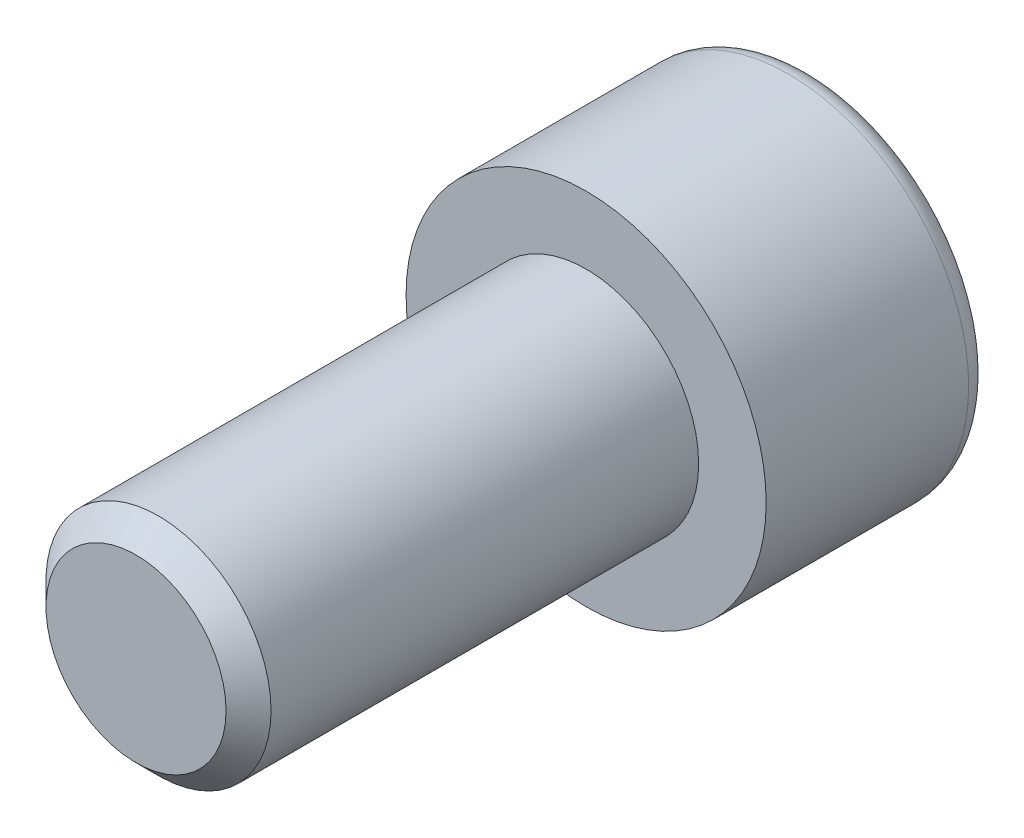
ISO-10303-21;
HEADER;
FILE_DESCRIPTION(('STEP AP214'),'2;1');
FILE_NAME('part.step','',(''),(''),'','','');
FILE_SCHEMA(('AUTOMOTIVE_DESIGN { 1 0 10303 214 1 1 1 1 }'));
ENDSEC;
DATA;
#1=APPLICATION_CONTEXT('core data for automotive mechanical design processes');
#2=APPLICATION_PROTOCOL_DEFINITION('international standard','automotive_design',2000,#1);
#3=PRODUCT_CONTEXT('',#1,'mechanical');
#4=PRODUCT('Part','Part','',(#3));
#5=PRODUCT_RELATED_PRODUCT_CATEGORY('part','',(#4));
#6=PRODUCT_DEFINITION_FORMATION('','',#4);
#7=PRODUCT_DEFINITION_CONTEXT('part definition',#1,'design');
#8=PRODUCT_DEFINITION('design','',#6,#7);
#9=PRODUCT_DEFINITION_SHAPE('','',#8);
#10=(LENGTH_UNIT() NAMED_UNIT(*) SI_UNIT(.MILLI.,.METRE.));
#11=(NAMED_UNIT(*) PLANE_ANGLE_UNIT() SI_UNIT($,.RADIAN.));
#12=(NAMED_UNIT(*) SI_UNIT($,.STERADIAN.) SOLID_ANGLE_UNIT());
#13=UNCERTAINTY_MEASURE_WITH_UNIT(LENGTH_MEASURE(1.E-05),#10,'distance_accuracy_value','');
#14=(GEOMETRIC_REPRESENTATION_CONTEXT(3) GLOBAL_UNCERTAINTY_ASSIGNED_CONTEXT((#13)) GLOBAL_UNIT_ASSIGNED_CONTEXT((#10,
#11,#12)) REPRESENTATION_CONTEXT('',''));
#15=CARTESIAN_POINT('',(0.,0.,0.));
#16=DIRECTION('',(0.,0.,1.));
#17=DIRECTION('',(1.,0.,0.));
#18=AXIS2_PLACEMENT_3D('',#15,#16,#17);
#19=CARTESIAN_POINT('',(0.,0.,-10.));
#20=DIRECTION('',(0.,0.,1.));
#21=DIRECTION('',(1.,0.,0.));
#22=AXIS2_PLACEMENT_3D('',#19,#20,#21);
#23=PLANE('',#22);
#24=CARTESIAN_POINT('',(0.,0.,-10.));
#25=DIRECTION('',(0.,0.,-1.));
#26=DIRECTION('',(-1.,0.,0.));
#27=AXIS2_PLACEMENT_3D('',#24,#25,#26);
#28=CIRCLE('',#27,7.);
#29=CARTESIAN_POINT('',(-7.,0.,-10.));
#30=VERTEX_POINT('',#29);
#31=EDGE_CURVE('E141',#30,#30,#28,.T.);
#32=ORIENTED_EDGE('',*,*,#31,.T.);
#33=EDGE_LOOP('',(#32));
#34=FACE_BOUND('',#33,.T.);
#35=DIRECTION('',(-0.86602540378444,0.499999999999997,0.));
#36=VECTOR('',#35,1.);
#37=CARTESIAN_POINT('',(0.,4.61880215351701,-10.));
#38=LINE('',#37,#36);
#39=CARTESIAN_POINT('',(4.,2.30940107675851,-10.));
#40=VERTEX_POINT('',#39);
#41=CARTESIAN_POINT('',(0.,4.61880215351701,-10.));
#42=VERTEX_POINT('',#41);
#43=EDGE_CURVE('E45',#40,#42,#38,.T.);
#44=ORIENTED_EDGE('',*,*,#43,.T.);
#45=DIRECTION('',(-0.866025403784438,-0.500000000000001,0.));
#46=VECTOR('',#45,1.);
#47=CARTESIAN_POINT('',(0.,4.61880215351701,-10.));
#48=LINE('',#47,#46);
#49=CARTESIAN_POINT('',(-4.,2.30940107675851,-10.));
#50=VERTEX_POINT('',#49);
#51=EDGE_CURVE('E85',#42,#50,#48,.T.);
#52=ORIENTED_EDGE('',*,*,#51,.T.);
#53=DIRECTION('',(0.,-1.,0.));
#54=VECTOR('',#53,1.);
#55=CARTESIAN_POINT('',(-4.,-2.30940107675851,-10.));
#56=LINE('',#55,#54);
#57=CARTESIAN_POINT('',(-4.,-2.30940107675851,-10.));
#58=VERTEX_POINT('',#57);
#59=EDGE_CURVE('E93',#50,#58,#56,.T.);
#60=ORIENTED_EDGE('',*,*,#59,.T.);
#61=DIRECTION('',(0.866025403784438,-0.500000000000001,0.));
#62=VECTOR('',#61,1.);
#63=CARTESIAN_POINT('',(0.,-4.61880215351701,-10.));
#64=LINE('',#63,#62);
#65=CARTESIAN_POINT('',(0.,-4.61880215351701,-10.));
#66=VERTEX_POINT('',#65);
#67=EDGE_CURVE('E111',#58,#66,#64,.T.);
#68=ORIENTED_EDGE('',*,*,#67,.T.);
#69=DIRECTION('',(0.86602540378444,0.499999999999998,0.));
#70=VECTOR('',#69,1.);
#71=CARTESIAN_POINT('',(0.,-4.61880215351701,-10.));
#72=LINE('',#71,#70);
#73=CARTESIAN_POINT('',(4.,-2.30940107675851,-10.));
#74=VERTEX_POINT('',#73);
#75=EDGE_CURVE('E114',#66,#74,#72,.T.);
#76=ORIENTED_EDGE('',*,*,#75,.T.);
#77=DIRECTION('',(0.,1.,0.));
#78=VECTOR('',#77,1.);
#79=CARTESIAN_POINT('',(4.,-2.30940107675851,-10.));
#80=LINE('',#79,#78);
#81=EDGE_CURVE('E104',#74,#40,#80,.T.);
#82=ORIENTED_EDGE('',*,*,#81,.T.);
#83=EDGE_LOOP('',(#44,#52,#60,#68,#76,#82));
#84=FACE_BOUND('',#83,.T.);
#85=ADVANCED_FACE('F31',(#34,#84),#23,.F.);
#86=CARTESIAN_POINT('',(0.,0.,-9.));
#87=DIRECTION('',(0.,0.,-1.));
#88=DIRECTION('',(-1.,0.,0.));
#89=AXIS2_PLACEMENT_3D('',#86,#87,#88);
#90=TOROIDAL_SURFACE('',#89,7.,0.999999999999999);
#91=ORIENTED_EDGE('',*,*,#31,.F.);
#92=EDGE_LOOP('',(#91));
#93=FACE_BOUND('',#92,.T.);
#94=CARTESIAN_POINT('',(0.,0.,-9.));
#95=DIRECTION('',(0.,0.,-1.));
#96=DIRECTION('',(-1.,0.,0.));
#97=AXIS2_PLACEMENT_3D('',#94,#95,#96);
#98=CIRCLE('',#97,8.);
#99=CARTESIAN_POINT('',(-8.,0.,-9.));
#100=VERTEX_POINT('',#99);
#101=EDGE_CURVE('E138',#100,#100,#98,.T.);
#102=ORIENTED_EDGE('',*,*,#101,.T.);
#103=EDGE_LOOP('',(#102));
#104=FACE_BOUND('',#103,.T.);
#105=ADVANCED_FACE('F160',(#93,#104),#90,.T.);
#106=CARTESIAN_POINT('',(0.,0.,0.));
#107=DIRECTION('',(0.,0.,-1.));
#108=DIRECTION('',(-1.,0.,0.));
#109=AXIS2_PLACEMENT_3D('',#106,#107,#108);
#110=CYLINDRICAL_SURFACE('',#109,8.);
#111=ORIENTED_EDGE('',*,*,#101,.F.);
#112=EDGE_LOOP('',(#111));
#113=FACE_BOUND('',#112,.T.);
#114=CARTESIAN_POINT('',(0.,0.,0.));
#115=DIRECTION('',(0.,0.,-1.));
#116=DIRECTION('',(-1.,0.,0.));
#117=AXIS2_PLACEMENT_3D('',#114,#115,#116);
#118=CIRCLE('',#117,8.);
#119=CARTESIAN_POINT('',(-8.,0.,0.));
#120=VERTEX_POINT('',#119);
#121=EDGE_CURVE('E99',#120,#120,#118,.T.);
#122=ORIENTED_EDGE('',*,*,#121,.T.);
#123=EDGE_LOOP('',(#122));
#124=FACE_BOUND('',#123,.T.);
#125=ADVANCED_FACE('F165',(#113,#124),#110,.T.);
#126=CARTESIAN_POINT('',(0.,0.,0.));
#127=DIRECTION('',(0.,0.,-1.));
#128=DIRECTION('',(-1.,0.,0.));
#129=AXIS2_PLACEMENT_3D('',#126,#127,#128);
#130=PLANE('',#129);
#131=CARTESIAN_POINT('',(0.,0.,0.));
#132=DIRECTION('',(0.,0.,1.));
#133=DIRECTION('',(1.,0.,0.));
#134=AXIS2_PLACEMENT_3D('',#131,#132,#133);
#135=CIRCLE('',#134,5.);
#136=CARTESIAN_POINT('',(5.,0.,0.));
#137=VERTEX_POINT('',#136);
#138=EDGE_CURVE('E105',#137,#137,#135,.T.);
#139=ORIENTED_EDGE('',*,*,#138,.F.);
#140=EDGE_LOOP('',(#139));
#141=FACE_BOUND('',#140,.T.);
#142=ORIENTED_EDGE('',*,*,#121,.F.);
#143=EDGE_LOOP('',(#142));
#144=FACE_BOUND('',#143,.T.);
#145=ADVANCED_FACE('F173',(#141,#144),#130,.F.);
#146=CARTESIAN_POINT('',(0.,4.61880215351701,-5.));
#147=DIRECTION('',(-0.499999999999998,-0.86602540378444,0.));
#148=DIRECTION('',(0.86602540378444,-0.499999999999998,0.));
#149=AXIS2_PLACEMENT_3D('',#146,#147,#148);
#150=PLANE('',#149);
#151=ORIENTED_EDGE('',*,*,#43,.F.);
#152=DIRECTION('',(0.,0.,-1.));
#153=VECTOR('',#152,1.);
#154=CARTESIAN_POINT('',(4.,2.30940107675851,-5.));
#155=LINE('',#154,#153);
#156=CARTESIAN_POINT('',(4.,2.30940107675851,-5.));
#157=VERTEX_POINT('',#156);
#158=EDGE_CURVE('E127',#157,#40,#155,.T.);
#159=ORIENTED_EDGE('',*,*,#158,.F.);
#160=DIRECTION('',(-0.86602540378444,0.499999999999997,0.));
#161=VECTOR('',#160,1.);
#162=CARTESIAN_POINT('',(0.,4.61880215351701,-5.));
#163=LINE('',#162,#161);
#164=CARTESIAN_POINT('',(0.,4.61880215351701,-5.));
#165=VERTEX_POINT('',#164);
#166=EDGE_CURVE('E98',#157,#165,#163,.T.);
#167=ORIENTED_EDGE('',*,*,#166,.T.);
#168=DIRECTION('',(0.,0.,-1.));
#169=VECTOR('',#168,1.);
#170=CARTESIAN_POINT('',(0.,4.61880215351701,-5.));
#171=LINE('',#170,#169);
#172=EDGE_CURVE('E87',#165,#42,#171,.T.);
#173=ORIENTED_EDGE('',*,*,#172,.T.);
#174=EDGE_LOOP('',(#151,#159,#167,#173));
#175=FACE_BOUND('',#174,.T.);
#176=ADVANCED_FACE('F96',(#175),#150,.T.);
#177=CARTESIAN_POINT('',(0.,4.61880215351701,-5.));
#178=DIRECTION('',(0.500000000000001,-0.866025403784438,0.));
#179=DIRECTION('',(0.866025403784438,0.500000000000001,0.));
#180=AXIS2_PLACEMENT_3D('',#177,#178,#179);
#181=PLANE('',#180);
#182=ORIENTED_EDGE('',*,*,#51,.F.);
#183=ORIENTED_EDGE('',*,*,#172,.F.);
#184=DIRECTION('',(-0.866025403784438,-0.500000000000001,0.));
#185=VECTOR('',#184,1.);
#186=CARTESIAN_POINT('',(0.,4.61880215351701,-5.));
#187=LINE('',#186,#185);
#188=CARTESIAN_POINT('',(-4.,2.30940107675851,-5.));
#189=VERTEX_POINT('',#188);
#190=EDGE_CURVE('E118',#165,#189,#187,.T.);
#191=ORIENTED_EDGE('',*,*,#190,.T.);
#192=DIRECTION('',(0.,0.,-1.));
#193=VECTOR('',#192,1.);
#194=CARTESIAN_POINT('',(-4.,2.30940107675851,-5.));
#195=LINE('',#194,#193);
#196=EDGE_CURVE('E89',#189,#50,#195,.T.);
#197=ORIENTED_EDGE('',*,*,#196,.T.);
#198=EDGE_LOOP('',(#182,#183,#191,#197));
#199=FACE_BOUND('',#198,.T.);
#200=ADVANCED_FACE('F86',(#199),#181,.T.);
#201=CARTESIAN_POINT('',(-4.,-2.30940107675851,-5.));
#202=DIRECTION('',(1.,0.,0.));
#203=DIRECTION('',(0.,0.,-1.));
#204=AXIS2_PLACEMENT_3D('',#201,#202,#203);
#205=PLANE('',#204);
#206=ORIENTED_EDGE('',*,*,#59,.F.);
#207=ORIENTED_EDGE('',*,*,#196,.F.);
#208=DIRECTION('',(0.,-1.,0.));
#209=VECTOR('',#208,1.);
#210=CARTESIAN_POINT('',(-4.,-2.30940107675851,-5.));
#211=LINE('',#210,#209);
#212=CARTESIAN_POINT('',(-4.,-2.30940107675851,-5.));
#213=VERTEX_POINT('',#212);
#214=EDGE_CURVE('E120',#189,#213,#211,.T.);
#215=ORIENTED_EDGE('',*,*,#214,.T.);
#216=DIRECTION('',(0.,0.,-1.));
#217=VECTOR('',#216,1.);
#218=CARTESIAN_POINT('',(-4.,-2.30940107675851,-5.));
#219=LINE('',#218,#217);
#220=EDGE_CURVE('E133',#213,#58,#219,.T.);
#221=ORIENTED_EDGE('',*,*,#220,.T.);
#222=EDGE_LOOP('',(#206,#207,#215,#221));
#223=FACE_BOUND('',#222,.T.);
#224=ADVANCED_FACE('F188',(#223),#205,.T.);
#225=CARTESIAN_POINT('',(0.,-4.61880215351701,-5.));
#226=DIRECTION('',(0.500000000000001,0.866025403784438,0.));
#227=DIRECTION('',(-0.866025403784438,0.500000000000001,0.));
#228=AXIS2_PLACEMENT_3D('',#225,#226,#227);
#229=PLANE('',#228);
#230=ORIENTED_EDGE('',*,*,#67,.F.);
#231=ORIENTED_EDGE('',*,*,#220,.F.);
#232=DIRECTION('',(0.866025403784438,-0.500000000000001,0.));
#233=VECTOR('',#232,1.);
#234=CARTESIAN_POINT('',(0.,-4.61880215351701,-5.));
#235=LINE('',#234,#233);
#236=CARTESIAN_POINT('',(0.,-4.61880215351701,-5.));
#237=VERTEX_POINT('',#236);
#238=EDGE_CURVE('E122',#213,#237,#235,.T.);
#239=ORIENTED_EDGE('',*,*,#238,.T.);
#240=DIRECTION('',(0.,0.,-1.));
#241=VECTOR('',#240,1.);
#242=CARTESIAN_POINT('',(0.,-4.61880215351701,-5.));
#243=LINE('',#242,#241);
#244=EDGE_CURVE('E131',#237,#66,#243,.T.);
#245=ORIENTED_EDGE('',*,*,#244,.T.);
#246=EDGE_LOOP('',(#230,#231,#239,#245));
#247=FACE_BOUND('',#246,.T.);
#248=ADVANCED_FACE('F191',(#247),#229,.T.);
#249=CARTESIAN_POINT('',(0.,-4.61880215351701,-5.));
#250=DIRECTION('',(-0.499999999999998,0.86602540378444,0.));
#251=DIRECTION('',(-0.86602540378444,-0.499999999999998,0.));
#252=AXIS2_PLACEMENT_3D('',#249,#250,#251);
#253=PLANE('',#252);
#254=ORIENTED_EDGE('',*,*,#75,.F.);
#255=ORIENTED_EDGE('',*,*,#244,.F.);
#256=DIRECTION('',(0.86602540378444,0.499999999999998,0.));
#257=VECTOR('',#256,1.);
#258=CARTESIAN_POINT('',(0.,-4.61880215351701,-5.));
#259=LINE('',#258,#257);
#260=CARTESIAN_POINT('',(4.,-2.30940107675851,-5.));
#261=VERTEX_POINT('',#260);
#262=EDGE_CURVE('E124',#237,#261,#259,.T.);
#263=ORIENTED_EDGE('',*,*,#262,.T.);
#264=DIRECTION('',(0.,0.,-1.));
#265=VECTOR('',#264,1.);
#266=CARTESIAN_POINT('',(4.,-2.30940107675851,-5.));
#267=LINE('',#266,#265);
#268=EDGE_CURVE('E129',#261,#74,#267,.T.);
#269=ORIENTED_EDGE('',*,*,#268,.T.);
#270=EDGE_LOOP('',(#254,#255,#263,#269));
#271=FACE_BOUND('',#270,.T.);
#272=ADVANCED_FACE('F195',(#271),#253,.T.);
#273=CARTESIAN_POINT('',(4.,-2.30940107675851,-5.));
#274=DIRECTION('',(-1.,0.,0.));
#275=DIRECTION('',(0.,-1.,0.));
#276=AXIS2_PLACEMENT_3D('',#273,#274,#275);
#277=PLANE('',#276);
#278=ORIENTED_EDGE('',*,*,#81,.F.);
#279=ORIENTED_EDGE('',*,*,#268,.F.);
#280=DIRECTION('',(0.,1.,0.));
#281=VECTOR('',#280,1.);
#282=CARTESIAN_POINT('',(4.,-2.30940107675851,-5.));
#283=LINE('',#282,#281);
#284=EDGE_CURVE('E52',#261,#157,#283,.T.);
#285=ORIENTED_EDGE('',*,*,#284,.T.);
#286=ORIENTED_EDGE('',*,*,#158,.T.);
#287=EDGE_LOOP('',(#278,#279,#285,#286));
#288=FACE_BOUND('',#287,.T.);
#289=ADVANCED_FACE('F199',(#288),#277,.T.);
#290=CARTESIAN_POINT('',(4.,2.30940107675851,-5.));
#291=DIRECTION('',(0.,0.,1.));
#292=DIRECTION('',(1.,0.,0.));
#293=AXIS2_PLACEMENT_3D('',#290,#291,#292);
#294=PLANE('',#293);
#295=ORIENTED_EDGE('',*,*,#166,.F.);
#296=ORIENTED_EDGE('',*,*,#284,.F.);
#297=ORIENTED_EDGE('',*,*,#262,.F.);
#298=ORIENTED_EDGE('',*,*,#238,.F.);
#299=ORIENTED_EDGE('',*,*,#214,.F.);
#300=ORIENTED_EDGE('',*,*,#190,.F.);
#301=EDGE_LOOP('',(#295,#296,#297,#298,#299,#300));
#302=FACE_BOUND('',#301,.T.);
#303=ADVANCED_FACE('F203',(#302),#294,.F.);
#304=CARTESIAN_POINT('',(0.,0.,20.));
#305=DIRECTION('',(0.,0.,1.));
#306=DIRECTION('',(1.,0.,0.));
#307=AXIS2_PLACEMENT_3D('',#304,#305,#306);
#308=PLANE('',#307);
#309=CARTESIAN_POINT('',(0.,0.,20.));
#310=DIRECTION('',(0.,0.,1.));
#311=DIRECTION('',(1.,0.,0.));
#312=AXIS2_PLACEMENT_3D('',#309,#310,#311);
#313=CIRCLE('',#312,4.);
#314=CARTESIAN_POINT('',(4.,0.,20.));
#315=VERTEX_POINT('',#314);
#316=EDGE_CURVE('E38',#315,#315,#313,.T.);
#317=ORIENTED_EDGE('',*,*,#316,.T.);
#318=EDGE_LOOP('',(#317));
#319=FACE_BOUND('',#318,.T.);
#320=ADVANCED_FACE('F146',(#319),#308,.T.);
#321=CARTESIAN_POINT('',(0.,0.,0.));
#322=DIRECTION('',(0.,0.,1.));
#323=DIRECTION('',(1.,0.,0.));
#324=AXIS2_PLACEMENT_3D('',#321,#322,#323);
#325=CYLINDRICAL_SURFACE('',#324,5.);
#326=CARTESIAN_POINT('',(0.,0.,19.));
#327=DIRECTION('',(0.,0.,1.));
#328=DIRECTION('',(1.,0.,0.));
#329=AXIS2_PLACEMENT_3D('',#326,#327,#328);
#330=CIRCLE('',#329,5.);
#331=CARTESIAN_POINT('',(5.,0.,19.));
#332=VERTEX_POINT('',#331);
#333=EDGE_CURVE('E11',#332,#332,#330,.F.);
#334=ORIENTED_EDGE('',*,*,#333,.T.);
#335=EDGE_LOOP('',(#334));
#336=FACE_BOUND('',#335,.T.);
#337=ORIENTED_EDGE('',*,*,#138,.T.);
#338=EDGE_LOOP('',(#337));
#339=FACE_BOUND('',#338,.T.);
#340=ADVANCED_FACE('F150',(#336,#339),#325,.T.);
#341=CARTESIAN_POINT('',(0.,0.,20.));
#342=DIRECTION('',(0.,0.,-1.));
#343=DIRECTION('',(-1.,0.,0.));
#344=AXIS2_PLACEMENT_3D('',#341,#342,#343);
#345=CONICAL_SURFACE('',#344,4.,0.785398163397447);
#346=ORIENTED_EDGE('',*,*,#333,.F.);
#347=EDGE_LOOP('',(#346));
#348=FACE_BOUND('',#347,.T.);
#349=ORIENTED_EDGE('',*,*,#316,.F.);
#350=EDGE_LOOP('',(#349));
#351=FACE_BOUND('',#350,.T.);
#352=ADVANCED_FACE('F148',(#348,#351),#345,.T.);
#353=CLOSED_SHELL('',(#85,#105,#125,#145,#176,#200,#224,#248,#272,#289,#303,#320,#340,#352));
#354=MANIFOLD_SOLID_BREP('B2',#353);
#355=ADVANCED_BREP_SHAPE_REPRESENTATION('',(#18,#354),#14);
#356=SHAPE_DEFINITION_REPRESENTATION(#9,#355);
ENDSEC;
END-ISO-10303-21;
